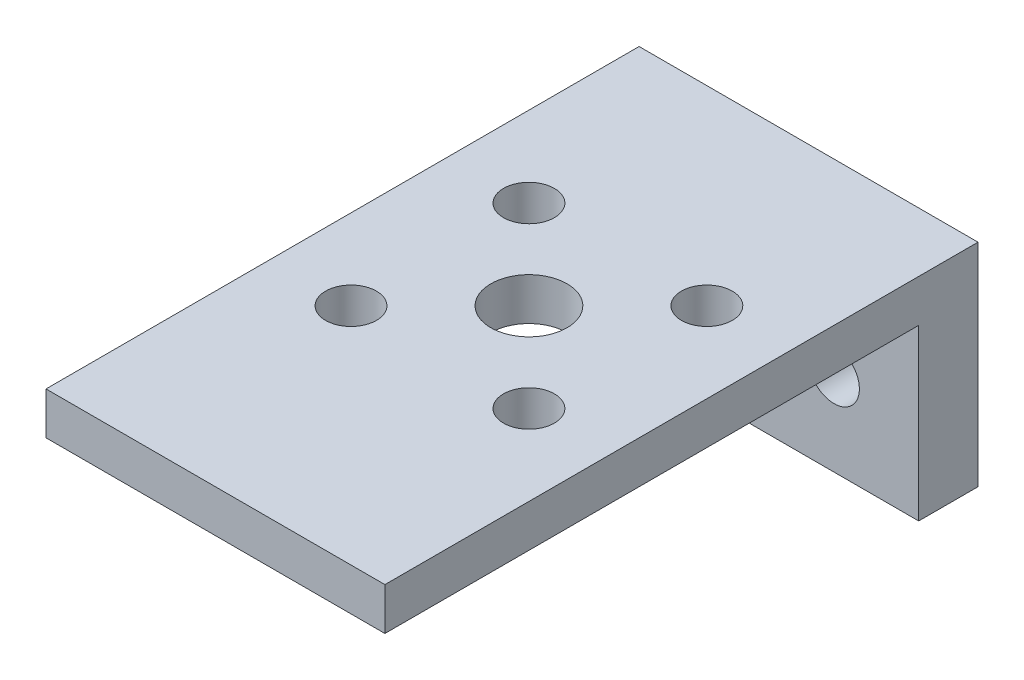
ISO-10303-21;
HEADER;
FILE_DESCRIPTION(('STEP AP214'),'2;1');
FILE_NAME('part.step','',(''),(''),'','','');
FILE_SCHEMA(('AUTOMOTIVE_DESIGN { 1 0 10303 214 1 1 1 1 }'));
ENDSEC;
DATA;
#1=APPLICATION_CONTEXT('core data for automotive mechanical design processes');
#2=APPLICATION_PROTOCOL_DEFINITION('international standard','automotive_design',2000,#1);
#3=PRODUCT_CONTEXT('',#1,'mechanical');
#4=PRODUCT('Part','Part','',(#3));
#5=PRODUCT_RELATED_PRODUCT_CATEGORY('part','',(#4));
#6=PRODUCT_DEFINITION_FORMATION('','',#4);
#7=PRODUCT_DEFINITION_CONTEXT('part definition',#1,'design');
#8=PRODUCT_DEFINITION('design','',#6,#7);
#9=PRODUCT_DEFINITION_SHAPE('','',#8);
#10=(LENGTH_UNIT() NAMED_UNIT(*) SI_UNIT(.MILLI.,.METRE.));
#11=(NAMED_UNIT(*) PLANE_ANGLE_UNIT() SI_UNIT($,.RADIAN.));
#12=(NAMED_UNIT(*) SI_UNIT($,.STERADIAN.) SOLID_ANGLE_UNIT());
#13=UNCERTAINTY_MEASURE_WITH_UNIT(LENGTH_MEASURE(1.E-05),#10,'distance_accuracy_value','');
#14=(GEOMETRIC_REPRESENTATION_CONTEXT(3) GLOBAL_UNCERTAINTY_ASSIGNED_CONTEXT((#13)) GLOBAL_UNIT_ASSIGNED_CONTEXT((#10,
#11,#12)) REPRESENTATION_CONTEXT('',''));
#15=CARTESIAN_POINT('',(0.,0.,0.));
#16=DIRECTION('',(0.,0.,1.));
#17=DIRECTION('',(1.,0.,0.));
#18=AXIS2_PLACEMENT_3D('',#15,#16,#17);
#19=CARTESIAN_POINT('',(-20.,5.,-35.));
#20=DIRECTION('',(0.,0.,-1.));
#21=DIRECTION('',(-1.,0.,0.));
#22=AXIS2_PLACEMENT_3D('',#19,#20,#21);
#23=PLANE('',#22);
#24=CARTESIAN_POINT('',(-10.,-10.,-35.));
#25=DIRECTION('',(0.,0.,-1.));
#26=DIRECTION('',(-1.,0.,0.));
#27=AXIS2_PLACEMENT_3D('',#24,#25,#26);
#28=CIRCLE('',#27,3.);
#29=CARTESIAN_POINT('',(-13.,-10.,-35.));
#30=VERTEX_POINT('',#29);
#31=EDGE_CURVE('E169',#30,#30,#28,.T.);
#32=ORIENTED_EDGE('',*,*,#31,.F.);
#33=EDGE_LOOP('',(#32));
#34=FACE_BOUND('',#33,.T.);
#35=CARTESIAN_POINT('',(10.,-9.99999999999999,-35.));
#36=DIRECTION('',(0.,0.,-1.));
#37=DIRECTION('',(-1.,0.,0.));
#38=AXIS2_PLACEMENT_3D('',#35,#36,#37);
#39=CIRCLE('',#38,3.);
#40=CARTESIAN_POINT('',(7.,-9.99999999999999,-35.));
#41=VERTEX_POINT('',#40);
#42=EDGE_CURVE('E179',#41,#41,#39,.T.);
#43=ORIENTED_EDGE('',*,*,#42,.F.);
#44=EDGE_LOOP('',(#43));
#45=FACE_BOUND('',#44,.T.);
#46=DIRECTION('',(0.,-1.,0.));
#47=VECTOR('',#46,1.);
#48=CARTESIAN_POINT('',(20.,5.,-35.));
#49=LINE('',#48,#47);
#50=CARTESIAN_POINT('',(20.,5.,-35.));
#51=VERTEX_POINT('',#50);
#52=CARTESIAN_POINT('',(20.,-20.,-35.));
#53=VERTEX_POINT('',#52);
#54=EDGE_CURVE('E48',#51,#53,#49,.T.);
#55=ORIENTED_EDGE('',*,*,#54,.T.);
#56=DIRECTION('',(1.,0.,0.));
#57=VECTOR('',#56,1.);
#58=CARTESIAN_POINT('',(20.,-20.,-35.));
#59=LINE('',#58,#57);
#60=CARTESIAN_POINT('',(-20.,-20.,-35.));
#61=VERTEX_POINT('',#60);
#62=EDGE_CURVE('E123',#61,#53,#59,.T.);
#63=ORIENTED_EDGE('',*,*,#62,.F.);
#64=DIRECTION('',(0.,-1.,0.));
#65=VECTOR('',#64,1.);
#66=CARTESIAN_POINT('',(-20.,5.,-35.));
#67=LINE('',#66,#65);
#68=CARTESIAN_POINT('',(-20.,5.,-35.));
#69=VERTEX_POINT('',#68);
#70=EDGE_CURVE('E11',#69,#61,#67,.T.);
#71=ORIENTED_EDGE('',*,*,#70,.F.);
#72=DIRECTION('',(1.,0.,0.));
#73=VECTOR('',#72,1.);
#74=CARTESIAN_POINT('',(-20.,5.,-35.));
#75=LINE('',#74,#73);
#76=EDGE_CURVE('E138',#69,#51,#75,.T.);
#77=ORIENTED_EDGE('',*,*,#76,.T.);
#78=EDGE_LOOP('',(#55,#63,#71,#77));
#79=FACE_BOUND('',#78,.T.);
#80=ADVANCED_FACE('F45',(#34,#45,#79),#23,.T.);
#81=CARTESIAN_POINT('',(-20.,5.,-35.));
#82=DIRECTION('',(1.,0.,0.));
#83=DIRECTION('',(0.,0.,-1.));
#84=AXIS2_PLACEMENT_3D('',#81,#82,#83);
#85=PLANE('',#84);
#86=ORIENTED_EDGE('',*,*,#70,.T.);
#87=DIRECTION('',(0.,0.,-1.));
#88=VECTOR('',#87,1.);
#89=CARTESIAN_POINT('',(-20.,-20.,-35.));
#90=LINE('',#89,#88);
#91=CARTESIAN_POINT('',(-20.,-20.,-28.));
#92=VERTEX_POINT('',#91);
#93=EDGE_CURVE('E118',#92,#61,#90,.T.);
#94=ORIENTED_EDGE('',*,*,#93,.F.);
#95=DIRECTION('',(0.,1.,0.));
#96=VECTOR('',#95,1.);
#97=CARTESIAN_POINT('',(-20.,-20.,-28.));
#98=LINE('',#97,#96);
#99=CARTESIAN_POINT('',(-20.,0.,-28.));
#100=VERTEX_POINT('',#99);
#101=EDGE_CURVE('E113',#92,#100,#98,.T.);
#102=ORIENTED_EDGE('',*,*,#101,.T.);
#103=DIRECTION('',(0.,0.,1.));
#104=VECTOR('',#103,1.);
#105=CARTESIAN_POINT('',(-20.,0.,-35.));
#106=LINE('',#105,#104);
#107=CARTESIAN_POINT('',(-20.,0.,35.));
#108=VERTEX_POINT('',#107);
#109=EDGE_CURVE('E84',#100,#108,#106,.T.);
#110=ORIENTED_EDGE('',*,*,#109,.T.);
#111=DIRECTION('',(0.,-1.,0.));
#112=VECTOR('',#111,1.);
#113=CARTESIAN_POINT('',(-20.,5.,35.));
#114=LINE('',#113,#112);
#115=CARTESIAN_POINT('',(-20.,5.,35.));
#116=VERTEX_POINT('',#115);
#117=EDGE_CURVE('E54',#116,#108,#114,.T.);
#118=ORIENTED_EDGE('',*,*,#117,.F.);
#119=DIRECTION('',(0.,0.,1.));
#120=VECTOR('',#119,1.);
#121=CARTESIAN_POINT('',(-20.,5.,-35.));
#122=LINE('',#121,#120);
#123=EDGE_CURVE('E147',#69,#116,#122,.T.);
#124=ORIENTED_EDGE('',*,*,#123,.F.);
#125=EDGE_LOOP('',(#86,#94,#102,#110,#118,#124));
#126=FACE_BOUND('',#125,.T.);
#127=ADVANCED_FACE('F170',(#126),#85,.F.);
#128=CARTESIAN_POINT('',(-20.,5.,35.));
#129=DIRECTION('',(0.,0.,-1.));
#130=DIRECTION('',(-1.,0.,0.));
#131=AXIS2_PLACEMENT_3D('',#128,#129,#130);
#132=PLANE('',#131);
#133=DIRECTION('',(1.,0.,0.));
#134=VECTOR('',#133,1.);
#135=CARTESIAN_POINT('',(-20.,0.,35.));
#136=LINE('',#135,#134);
#137=CARTESIAN_POINT('',(20.,0.,35.));
#138=VERTEX_POINT('',#137);
#139=EDGE_CURVE('E133',#108,#138,#136,.T.);
#140=ORIENTED_EDGE('',*,*,#139,.T.);
#141=DIRECTION('',(0.,-1.,0.));
#142=VECTOR('',#141,1.);
#143=CARTESIAN_POINT('',(20.,5.,35.));
#144=LINE('',#143,#142);
#145=CARTESIAN_POINT('',(20.,5.,35.));
#146=VERTEX_POINT('',#145);
#147=EDGE_CURVE('E156',#146,#138,#144,.T.);
#148=ORIENTED_EDGE('',*,*,#147,.F.);
#149=DIRECTION('',(1.,0.,0.));
#150=VECTOR('',#149,1.);
#151=CARTESIAN_POINT('',(-20.,5.,35.));
#152=LINE('',#151,#150);
#153=EDGE_CURVE('E144',#116,#146,#152,.T.);
#154=ORIENTED_EDGE('',*,*,#153,.F.);
#155=ORIENTED_EDGE('',*,*,#117,.T.);
#156=EDGE_LOOP('',(#140,#148,#154,#155));
#157=FACE_BOUND('',#156,.T.);
#158=ADVANCED_FACE('F165',(#157),#132,.F.);
#159=CARTESIAN_POINT('',(20.,5.,-35.));
#160=DIRECTION('',(1.,0.,0.));
#161=DIRECTION('',(0.,0.,-1.));
#162=AXIS2_PLACEMENT_3D('',#159,#160,#161);
#163=PLANE('',#162);
#164=DIRECTION('',(0.,0.,1.));
#165=VECTOR('',#164,1.);
#166=CARTESIAN_POINT('',(20.,0.,-35.));
#167=LINE('',#166,#165);
#168=CARTESIAN_POINT('',(20.,0.,-28.));
#169=VERTEX_POINT('',#168);
#170=EDGE_CURVE('E128',#169,#138,#167,.T.);
#171=ORIENTED_EDGE('',*,*,#170,.F.);
#172=DIRECTION('',(0.,1.,0.));
#173=VECTOR('',#172,1.);
#174=CARTESIAN_POINT('',(20.,-20.,-28.));
#175=LINE('',#174,#173);
#176=CARTESIAN_POINT('',(20.,-20.,-28.));
#177=VERTEX_POINT('',#176);
#178=EDGE_CURVE('E112',#177,#169,#175,.T.);
#179=ORIENTED_EDGE('',*,*,#178,.F.);
#180=DIRECTION('',(0.,0.,1.));
#181=VECTOR('',#180,1.);
#182=CARTESIAN_POINT('',(20.,-20.,-35.));
#183=LINE('',#182,#181);
#184=EDGE_CURVE('E119',#53,#177,#183,.T.);
#185=ORIENTED_EDGE('',*,*,#184,.F.);
#186=ORIENTED_EDGE('',*,*,#54,.F.);
#187=DIRECTION('',(0.,0.,1.));
#188=VECTOR('',#187,1.);
#189=CARTESIAN_POINT('',(20.,5.,-35.));
#190=LINE('',#189,#188);
#191=EDGE_CURVE('E141',#51,#146,#190,.T.);
#192=ORIENTED_EDGE('',*,*,#191,.T.);
#193=ORIENTED_EDGE('',*,*,#147,.T.);
#194=EDGE_LOOP('',(#171,#179,#185,#186,#192,#193));
#195=FACE_BOUND('',#194,.T.);
#196=ADVANCED_FACE('F126',(#195),#163,.T.);
#197=CARTESIAN_POINT('',(0.,5.,0.));
#198=DIRECTION('',(0.,-1.,0.));
#199=DIRECTION('',(0.,0.,-1.));
#200=AXIS2_PLACEMENT_3D('',#197,#198,#199);
#201=PLANE('',#200);
#202=CARTESIAN_POINT('',(10.5,5.,-12.5));
#203=DIRECTION('',(0.,-1.,0.));
#204=DIRECTION('',(0.,0.,-1.));
#205=AXIS2_PLACEMENT_3D('',#202,#203,#204);
#206=CIRCLE('',#205,3.);
#207=CARTESIAN_POINT('',(10.5,5.,-15.5));
#208=VERTEX_POINT('',#207);
#209=EDGE_CURVE('E188',#208,#208,#206,.T.);
#210=ORIENTED_EDGE('',*,*,#209,.T.);
#211=EDGE_LOOP('',(#210));
#212=FACE_BOUND('',#211,.T.);
#213=CARTESIAN_POINT('',(-10.5,5.,-12.5));
#214=DIRECTION('',(0.,-1.,0.));
#215=DIRECTION('',(0.,0.,-1.));
#216=AXIS2_PLACEMENT_3D('',#213,#214,#215);
#217=CIRCLE('',#216,3.);
#218=CARTESIAN_POINT('',(-10.5,5.,-15.5));
#219=VERTEX_POINT('',#218);
#220=EDGE_CURVE('E195',#219,#219,#217,.T.);
#221=ORIENTED_EDGE('',*,*,#220,.T.);
#222=EDGE_LOOP('',(#221));
#223=FACE_BOUND('',#222,.T.);
#224=CARTESIAN_POINT('',(-10.5,5.,8.5));
#225=DIRECTION('',(0.,-1.,0.));
#226=DIRECTION('',(0.,0.,-1.));
#227=AXIS2_PLACEMENT_3D('',#224,#225,#226);
#228=CIRCLE('',#227,3.);
#229=CARTESIAN_POINT('',(-10.5,5.,5.5));
#230=VERTEX_POINT('',#229);
#231=EDGE_CURVE('E199',#230,#230,#228,.T.);
#232=ORIENTED_EDGE('',*,*,#231,.T.);
#233=EDGE_LOOP('',(#232));
#234=FACE_BOUND('',#233,.T.);
#235=CARTESIAN_POINT('',(10.5,5.,8.5));
#236=DIRECTION('',(0.,-1.,0.));
#237=DIRECTION('',(0.,0.,-1.));
#238=AXIS2_PLACEMENT_3D('',#235,#236,#237);
#239=CIRCLE('',#238,3.);
#240=CARTESIAN_POINT('',(10.5,5.,5.5));
#241=VERTEX_POINT('',#240);
#242=EDGE_CURVE('E203',#241,#241,#239,.T.);
#243=ORIENTED_EDGE('',*,*,#242,.T.);
#244=EDGE_LOOP('',(#243));
#245=FACE_BOUND('',#244,.T.);
#246=CARTESIAN_POINT('',(0.,5.,-2.));
#247=DIRECTION('',(0.,-1.,0.));
#248=DIRECTION('',(0.,0.,-1.));
#249=AXIS2_PLACEMENT_3D('',#246,#247,#248);
#250=CIRCLE('',#249,4.5);
#251=CARTESIAN_POINT('',(0.,5.,-6.5));
#252=VERTEX_POINT('',#251);
#253=EDGE_CURVE('E207',#252,#252,#250,.T.);
#254=ORIENTED_EDGE('',*,*,#253,.T.);
#255=EDGE_LOOP('',(#254));
#256=FACE_BOUND('',#255,.T.);
#257=ORIENTED_EDGE('',*,*,#76,.F.);
#258=ORIENTED_EDGE('',*,*,#123,.T.);
#259=ORIENTED_EDGE('',*,*,#153,.T.);
#260=ORIENTED_EDGE('',*,*,#191,.F.);
#261=EDGE_LOOP('',(#257,#258,#259,#260));
#262=FACE_BOUND('',#261,.T.);
#263=ADVANCED_FACE('F162',(#212,#223,#234,#245,#256,#262),#201,.F.);
#264=CARTESIAN_POINT('',(0.,0.,0.));
#265=DIRECTION('',(0.,-1.,0.));
#266=DIRECTION('',(0.,0.,-1.));
#267=AXIS2_PLACEMENT_3D('',#264,#265,#266);
#268=PLANE('',#267);
#269=CARTESIAN_POINT('',(10.5,0.,-12.5));
#270=DIRECTION('',(0.,-1.,0.));
#271=DIRECTION('',(0.,0.,-1.));
#272=AXIS2_PLACEMENT_3D('',#269,#270,#271);
#273=CIRCLE('',#272,3.);
#274=CARTESIAN_POINT('',(10.5,0.,-15.5));
#275=VERTEX_POINT('',#274);
#276=EDGE_CURVE('E216',#275,#275,#273,.T.);
#277=ORIENTED_EDGE('',*,*,#276,.F.);
#278=EDGE_LOOP('',(#277));
#279=FACE_BOUND('',#278,.T.);
#280=CARTESIAN_POINT('',(-10.5,0.,-12.5));
#281=DIRECTION('',(0.,-1.,0.));
#282=DIRECTION('',(0.,0.,-1.));
#283=AXIS2_PLACEMENT_3D('',#280,#281,#282);
#284=CIRCLE('',#283,3.);
#285=CARTESIAN_POINT('',(-10.5,0.,-15.5));
#286=VERTEX_POINT('',#285);
#287=EDGE_CURVE('E220',#286,#286,#284,.T.);
#288=ORIENTED_EDGE('',*,*,#287,.F.);
#289=EDGE_LOOP('',(#288));
#290=FACE_BOUND('',#289,.T.);
#291=CARTESIAN_POINT('',(-10.5,0.,8.5));
#292=DIRECTION('',(0.,-1.,0.));
#293=DIRECTION('',(0.,0.,-1.));
#294=AXIS2_PLACEMENT_3D('',#291,#292,#293);
#295=CIRCLE('',#294,3.);
#296=CARTESIAN_POINT('',(-10.5,0.,5.5));
#297=VERTEX_POINT('',#296);
#298=EDGE_CURVE('E224',#297,#297,#295,.T.);
#299=ORIENTED_EDGE('',*,*,#298,.F.);
#300=EDGE_LOOP('',(#299));
#301=FACE_BOUND('',#300,.T.);
#302=CARTESIAN_POINT('',(10.5,0.,8.5));
#303=DIRECTION('',(0.,-1.,0.));
#304=DIRECTION('',(0.,0.,-1.));
#305=AXIS2_PLACEMENT_3D('',#302,#303,#304);
#306=CIRCLE('',#305,3.);
#307=CARTESIAN_POINT('',(10.5,0.,5.5));
#308=VERTEX_POINT('',#307);
#309=EDGE_CURVE('E215',#308,#308,#306,.T.);
#310=ORIENTED_EDGE('',*,*,#309,.F.);
#311=EDGE_LOOP('',(#310));
#312=FACE_BOUND('',#311,.T.);
#313=CARTESIAN_POINT('',(0.,0.,-2.));
#314=DIRECTION('',(0.,-1.,0.));
#315=DIRECTION('',(0.,0.,-1.));
#316=AXIS2_PLACEMENT_3D('',#313,#314,#315);
#317=CIRCLE('',#316,4.5);
#318=CARTESIAN_POINT('',(0.,0.,-6.5));
#319=VERTEX_POINT('',#318);
#320=EDGE_CURVE('E211',#319,#319,#317,.T.);
#321=ORIENTED_EDGE('',*,*,#320,.F.);
#322=EDGE_LOOP('',(#321));
#323=FACE_BOUND('',#322,.T.);
#324=DIRECTION('',(-1.,0.,0.));
#325=VECTOR('',#324,1.);
#326=CARTESIAN_POINT('',(20.,0.,-28.));
#327=LINE('',#326,#325);
#328=EDGE_CURVE('E62',#169,#100,#327,.T.);
#329=ORIENTED_EDGE('',*,*,#328,.F.);
#330=ORIENTED_EDGE('',*,*,#170,.T.);
#331=ORIENTED_EDGE('',*,*,#139,.F.);
#332=ORIENTED_EDGE('',*,*,#109,.F.);
#333=EDGE_LOOP('',(#329,#330,#331,#332));
#334=FACE_BOUND('',#333,.T.);
#335=ADVANCED_FACE('F167',(#279,#290,#301,#312,#323,#334),#268,.T.);
#336=CARTESIAN_POINT('',(20.,-20.,-28.));
#337=DIRECTION('',(0.,0.,-1.));
#338=DIRECTION('',(-1.,0.,0.));
#339=AXIS2_PLACEMENT_3D('',#336,#337,#338);
#340=PLANE('',#339);
#341=CARTESIAN_POINT('',(-10.,-10.,-28.));
#342=DIRECTION('',(0.,0.,1.));
#343=DIRECTION('',(1.,0.,0.));
#344=AXIS2_PLACEMENT_3D('',#341,#342,#343);
#345=CIRCLE('',#344,3.);
#346=CARTESIAN_POINT('',(-7.,-10.,-28.));
#347=VERTEX_POINT('',#346);
#348=EDGE_CURVE('E183',#347,#347,#345,.T.);
#349=ORIENTED_EDGE('',*,*,#348,.F.);
#350=EDGE_LOOP('',(#349));
#351=FACE_BOUND('',#350,.T.);
#352=CARTESIAN_POINT('',(10.,-9.99999999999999,-28.));
#353=DIRECTION('',(0.,0.,1.));
#354=DIRECTION('',(1.,0.,0.));
#355=AXIS2_PLACEMENT_3D('',#352,#353,#354);
#356=CIRCLE('',#355,3.);
#357=CARTESIAN_POINT('',(13.,-9.99999999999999,-28.));
#358=VERTEX_POINT('',#357);
#359=EDGE_CURVE('E184',#358,#358,#356,.T.);
#360=ORIENTED_EDGE('',*,*,#359,.F.);
#361=EDGE_LOOP('',(#360));
#362=FACE_BOUND('',#361,.T.);
#363=ORIENTED_EDGE('',*,*,#328,.T.);
#364=ORIENTED_EDGE('',*,*,#101,.F.);
#365=DIRECTION('',(-1.,0.,0.));
#366=VECTOR('',#365,1.);
#367=CARTESIAN_POINT('',(20.,-20.,-28.));
#368=LINE('',#367,#366);
#369=EDGE_CURVE('E108',#177,#92,#368,.T.);
#370=ORIENTED_EDGE('',*,*,#369,.F.);
#371=ORIENTED_EDGE('',*,*,#178,.T.);
#372=EDGE_LOOP('',(#363,#364,#370,#371));
#373=FACE_BOUND('',#372,.T.);
#374=ADVANCED_FACE('F110',(#351,#362,#373),#340,.F.);
#375=CARTESIAN_POINT('',(0.,-20.,0.));
#376=DIRECTION('',(0.,-1.,0.));
#377=DIRECTION('',(0.,0.,-1.));
#378=AXIS2_PLACEMENT_3D('',#375,#376,#377);
#379=PLANE('',#378);
#380=ORIENTED_EDGE('',*,*,#184,.T.);
#381=ORIENTED_EDGE('',*,*,#369,.T.);
#382=ORIENTED_EDGE('',*,*,#93,.T.);
#383=ORIENTED_EDGE('',*,*,#62,.T.);
#384=EDGE_LOOP('',(#380,#381,#382,#383));
#385=FACE_BOUND('',#384,.T.);
#386=ADVANCED_FACE('F122',(#385),#379,.T.);
#387=CARTESIAN_POINT('',(10.,-9.99999999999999,-48.));
#388=DIRECTION('',(0.,0.,1.));
#389=DIRECTION('',(1.,0.,0.));
#390=AXIS2_PLACEMENT_3D('',#387,#388,#389);
#391=CYLINDRICAL_SURFACE('',#390,3.);
#392=ORIENTED_EDGE('',*,*,#42,.T.);
#393=EDGE_LOOP('',(#392));
#394=FACE_BOUND('',#393,.T.);
#395=ORIENTED_EDGE('',*,*,#359,.T.);
#396=EDGE_LOOP('',(#395));
#397=FACE_BOUND('',#396,.T.);
#398=ADVANCED_FACE('F269',(#394,#397),#391,.F.);
#399=CARTESIAN_POINT('',(-10.,-10.,-48.));
#400=DIRECTION('',(0.,0.,1.));
#401=DIRECTION('',(1.,0.,0.));
#402=AXIS2_PLACEMENT_3D('',#399,#400,#401);
#403=CYLINDRICAL_SURFACE('',#402,3.);
#404=ORIENTED_EDGE('',*,*,#31,.T.);
#405=EDGE_LOOP('',(#404));
#406=FACE_BOUND('',#405,.T.);
#407=ORIENTED_EDGE('',*,*,#348,.T.);
#408=EDGE_LOOP('',(#407));
#409=FACE_BOUND('',#408,.T.);
#410=ADVANCED_FACE('F244',(#406,#409),#403,.F.);
#411=CARTESIAN_POINT('',(0.,10.,-2.));
#412=DIRECTION('',(0.,-1.,0.));
#413=DIRECTION('',(0.,0.,-1.));
#414=AXIS2_PLACEMENT_3D('',#411,#412,#413);
#415=CYLINDRICAL_SURFACE('',#414,4.5);
#416=ORIENTED_EDGE('',*,*,#320,.T.);
#417=EDGE_LOOP('',(#416));
#418=FACE_BOUND('',#417,.T.);
#419=ORIENTED_EDGE('',*,*,#253,.F.);
#420=EDGE_LOOP('',(#419));
#421=FACE_BOUND('',#420,.T.);
#422=ADVANCED_FACE('F241',(#418,#421),#415,.F.);
#423=CARTESIAN_POINT('',(10.5,10.,8.5));
#424=DIRECTION('',(0.,-1.,0.));
#425=DIRECTION('',(0.,0.,-1.));
#426=AXIS2_PLACEMENT_3D('',#423,#424,#425);
#427=CYLINDRICAL_SURFACE('',#426,3.);
#428=ORIENTED_EDGE('',*,*,#309,.T.);
#429=EDGE_LOOP('',(#428));
#430=FACE_BOUND('',#429,.T.);
#431=ORIENTED_EDGE('',*,*,#242,.F.);
#432=EDGE_LOOP('',(#431));
#433=FACE_BOUND('',#432,.T.);
#434=ADVANCED_FACE('F232',(#430,#433),#427,.F.);
#435=CARTESIAN_POINT('',(-10.5,10.,8.5));
#436=DIRECTION('',(0.,-1.,0.));
#437=DIRECTION('',(0.,0.,-1.));
#438=AXIS2_PLACEMENT_3D('',#435,#436,#437);
#439=CYLINDRICAL_SURFACE('',#438,3.);
#440=ORIENTED_EDGE('',*,*,#298,.T.);
#441=EDGE_LOOP('',(#440));
#442=FACE_BOUND('',#441,.T.);
#443=ORIENTED_EDGE('',*,*,#231,.F.);
#444=EDGE_LOOP('',(#443));
#445=FACE_BOUND('',#444,.T.);
#446=ADVANCED_FACE('F290',(#442,#445),#439,.F.);
#447=CARTESIAN_POINT('',(-10.5,10.,-12.5));
#448=DIRECTION('',(0.,-1.,0.));
#449=DIRECTION('',(0.,0.,-1.));
#450=AXIS2_PLACEMENT_3D('',#447,#448,#449);
#451=CYLINDRICAL_SURFACE('',#450,3.);
#452=ORIENTED_EDGE('',*,*,#287,.T.);
#453=EDGE_LOOP('',(#452));
#454=FACE_BOUND('',#453,.T.);
#455=ORIENTED_EDGE('',*,*,#220,.F.);
#456=EDGE_LOOP('',(#455));
#457=FACE_BOUND('',#456,.T.);
#458=ADVANCED_FACE('F286',(#454,#457),#451,.F.);
#459=CARTESIAN_POINT('',(10.5,10.,-12.5));
#460=DIRECTION('',(0.,-1.,0.));
#461=DIRECTION('',(0.,0.,-1.));
#462=AXIS2_PLACEMENT_3D('',#459,#460,#461);
#463=CYLINDRICAL_SURFACE('',#462,3.);
#464=ORIENTED_EDGE('',*,*,#276,.T.);
#465=EDGE_LOOP('',(#464));
#466=FACE_BOUND('',#465,.T.);
#467=ORIENTED_EDGE('',*,*,#209,.F.);
#468=EDGE_LOOP('',(#467));
#469=FACE_BOUND('',#468,.T.);
#470=ADVANCED_FACE('F283',(#466,#469),#463,.F.);
#471=CLOSED_SHELL('',(#80,#127,#158,#196,#263,#335,#374,#386,#398,#410,#422,#434,#446,#458,#470));
#472=MANIFOLD_SOLID_BREP('B2',#471);
#473=ADVANCED_BREP_SHAPE_REPRESENTATION('',(#18,#472),#14);
#474=SHAPE_DEFINITION_REPRESENTATION(#9,#473);
ENDSEC;
END-ISO-10303-21;
